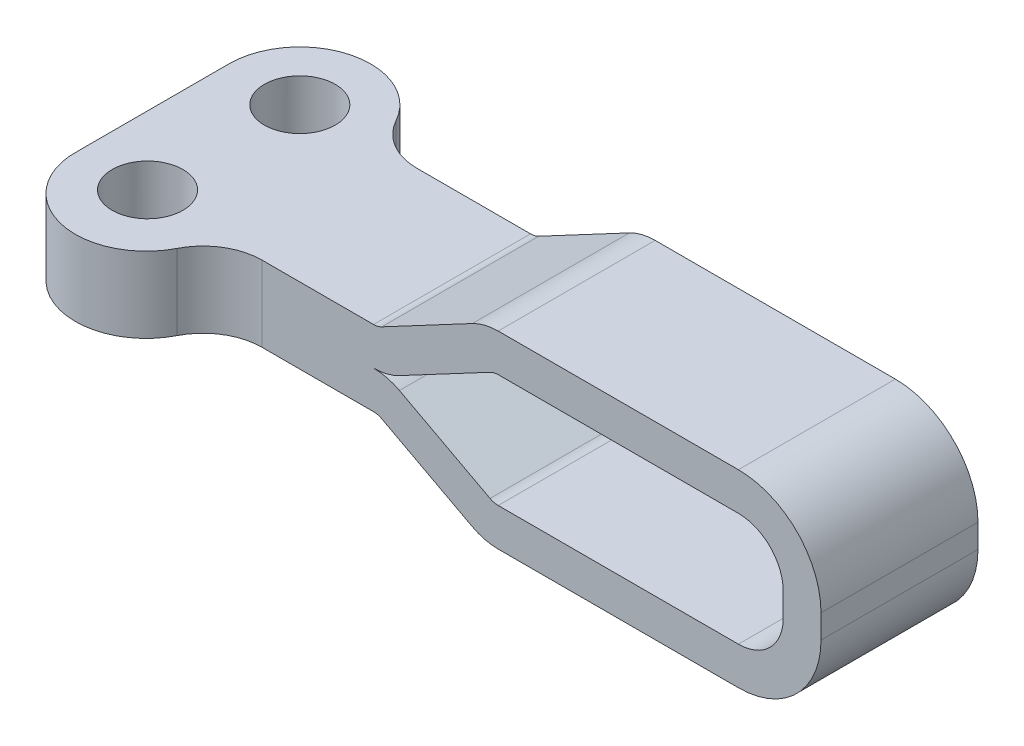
ISO-10303-21;
HEADER;
FILE_DESCRIPTION(('STEP AP214'),'2;1');
FILE_NAME('part.step','',(''),(''),'','','');
FILE_SCHEMA(('AUTOMOTIVE_DESIGN { 1 0 10303 214 1 1 1 1 }'));
ENDSEC;
DATA;
#1=APPLICATION_CONTEXT('core data for automotive mechanical design processes');
#2=APPLICATION_PROTOCOL_DEFINITION('international standard','automotive_design',2000,#1);
#3=PRODUCT_CONTEXT('',#1,'mechanical');
#4=PRODUCT('Part','Part','',(#3));
#5=PRODUCT_RELATED_PRODUCT_CATEGORY('part','',(#4));
#6=PRODUCT_DEFINITION_FORMATION('','',#4);
#7=PRODUCT_DEFINITION_CONTEXT('part definition',#1,'design');
#8=PRODUCT_DEFINITION('design','',#6,#7);
#9=PRODUCT_DEFINITION_SHAPE('','',#8);
#10=(LENGTH_UNIT() NAMED_UNIT(*) SI_UNIT(.MILLI.,.METRE.));
#11=(NAMED_UNIT(*) PLANE_ANGLE_UNIT() SI_UNIT($,.RADIAN.));
#12=(NAMED_UNIT(*) SI_UNIT($,.STERADIAN.) SOLID_ANGLE_UNIT());
#13=UNCERTAINTY_MEASURE_WITH_UNIT(LENGTH_MEASURE(1.E-05),#10,'distance_accuracy_value','');
#14=(GEOMETRIC_REPRESENTATION_CONTEXT(3) GLOBAL_UNCERTAINTY_ASSIGNED_CONTEXT((#13)) GLOBAL_UNIT_ASSIGNED_CONTEXT((#10,
#11,#12)) REPRESENTATION_CONTEXT('',''));
#15=CARTESIAN_POINT('',(0.,0.,0.));
#16=DIRECTION('',(0.,0.,1.));
#17=DIRECTION('',(1.,0.,0.));
#18=AXIS2_PLACEMENT_3D('',#15,#16,#17);
#19=CARTESIAN_POINT('',(29.93,1.6,0.149999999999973));
#20=DIRECTION('',(0.,0.,1.));
#21=DIRECTION('',(0.,-1.,0.));
#22=AXIS2_PLACEMENT_3D('',#19,#20,#21);
#23=PLANE('',#22);
#24=DIRECTION('',(0.,-1.,0.));
#25=VECTOR('',#24,1.);
#26=CARTESIAN_POINT('',(27.0794249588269,0.558341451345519,0.149999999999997));
#27=LINE('',#26,#25);
#28=CARTESIAN_POINT('',(27.0794249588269,0.5,0.149999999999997));
#29=VERTEX_POINT('',#28);
#30=CARTESIAN_POINT('',(27.0794249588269,-0.499999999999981,0.149999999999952));
#31=VERTEX_POINT('',#30);
#32=EDGE_CURVE('E243',#29,#31,#27,.T.);
#33=ORIENTED_EDGE('',*,*,#32,.T.);
#34=CARTESIAN_POINT('',(25.1794249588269,-0.5,0.149999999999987));
#35=DIRECTION('',(0.,0.,-1.));
#36=DIRECTION('',(0.,1.,0.));
#37=AXIS2_PLACEMENT_3D('',#34,#35,#36);
#38=CIRCLE('',#37,1.9);
#39=CARTESIAN_POINT('',(25.1794249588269,-2.4,0.149999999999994));
#40=VERTEX_POINT('',#39);
#41=EDGE_CURVE('E230',#31,#40,#38,.T.);
#42=ORIENTED_EDGE('',*,*,#41,.T.);
#43=DIRECTION('',(1.,0.,0.));
#44=VECTOR('',#43,1.);
#45=CARTESIAN_POINT('',(-0.467766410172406,-2.4,0.149999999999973));
#46=LINE('',#45,#44);
#47=CARTESIAN_POINT('',(15.0045161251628,-2.4,0.150000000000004));
#48=VERTEX_POINT('',#47);
#49=EDGE_CURVE('E223',#40,#48,#46,.F.);
#50=ORIENTED_EDGE('',*,*,#49,.T.);
#51=CARTESIAN_POINT('',(15.0045161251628,-1.6634,0.15));
#52=DIRECTION('',(0.,0.,-1.));
#53=DIRECTION('',(1.,0.,0.));
#54=AXIS2_PLACEMENT_3D('',#51,#52,#53);
#55=CIRCLE('',#54,0.7366);
#56=CARTESIAN_POINT('',(14.6587033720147,-2.31377919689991,0.149999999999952));
#57=VERTEX_POINT('',#56);
#58=EDGE_CURVE('E229',#57,#48,#55,.F.);
#59=ORIENTED_EDGE('',*,*,#58,.F.);
#60=DIRECTION('',(0.882947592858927,-0.469471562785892,0.));
#61=VECTOR('',#60,1.);
#62=CARTESIAN_POINT('',(1.66051566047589,4.59747980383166,0.149999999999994));
#63=LINE('',#62,#61);
#64=CARTESIAN_POINT('',(10.8215050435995,-0.273504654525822,0.149999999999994));
#65=VERTEX_POINT('',#64);
#66=EDGE_CURVE('E269',#57,#65,#63,.F.);
#67=ORIENTED_EDGE('',*,*,#66,.T.);
#68=CARTESIAN_POINT('',(9.72453778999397,-2.3366,0.149999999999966));
#69=DIRECTION('',(0.,0.,-1.));
#70=DIRECTION('',(1.,0.,0.));
#71=AXIS2_PLACEMENT_3D('',#68,#69,#70);
#72=CIRCLE('',#71,2.3366);
#73=CARTESIAN_POINT('',(9.72453778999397,0.,0.150000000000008));
#74=VERTEX_POINT('',#73);
#75=EDGE_CURVE('E245',#74,#65,#72,.T.);
#76=ORIENTED_EDGE('',*,*,#75,.F.);
#77=CARTESIAN_POINT('',(9.72453778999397,2.3366,0.15));
#78=DIRECTION('',(0.,0.,-1.));
#79=DIRECTION('',(1.,0.,0.));
#80=AXIS2_PLACEMENT_3D('',#77,#78,#79);
#81=CIRCLE('',#80,2.3366);
#82=CARTESIAN_POINT('',(10.8215050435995,0.273504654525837,0.149999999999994));
#83=VERTEX_POINT('',#82);
#84=EDGE_CURVE('E402',#83,#74,#81,.T.);
#85=ORIENTED_EDGE('',*,*,#84,.F.);
#86=DIRECTION('',(0.882947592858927,0.469471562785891,0.));
#87=VECTOR('',#86,1.);
#88=CARTESIAN_POINT('',(10.8215050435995,0.273504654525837,0.149999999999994));
#89=LINE('',#88,#87);
#90=CARTESIAN_POINT('',(14.6587033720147,2.3137791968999,0.14999999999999));
#91=VERTEX_POINT('',#90);
#92=EDGE_CURVE('E484',#83,#91,#89,.T.);
#93=ORIENTED_EDGE('',*,*,#92,.T.);
#94=CARTESIAN_POINT('',(15.0045161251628,1.6634,0.14999999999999));
#95=DIRECTION('',(0.,0.,-1.));
#96=DIRECTION('',(1.,0.,0.));
#97=AXIS2_PLACEMENT_3D('',#94,#95,#96);
#98=CIRCLE('',#97,0.7366);
#99=CARTESIAN_POINT('',(15.0045161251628,2.4,0.14999999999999));
#100=VERTEX_POINT('',#99);
#101=EDGE_CURVE('E418',#91,#100,#98,.T.);
#102=ORIENTED_EDGE('',*,*,#101,.T.);
#103=DIRECTION('',(1.,0.,0.));
#104=VECTOR('',#103,1.);
#105=CARTESIAN_POINT('',(29.3622335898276,2.4,0.149999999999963));
#106=LINE('',#105,#104);
#107=CARTESIAN_POINT('',(25.1794249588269,2.4,0.14999999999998));
#108=VERTEX_POINT('',#107);
#109=EDGE_CURVE('E362',#100,#108,#106,.T.);
#110=ORIENTED_EDGE('',*,*,#109,.T.);
#111=CARTESIAN_POINT('',(25.1794249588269,0.5,0.149999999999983));
#112=DIRECTION('',(0.,0.,-1.));
#113=DIRECTION('',(0.,1.,0.));
#114=AXIS2_PLACEMENT_3D('',#111,#112,#113);
#115=CIRCLE('',#114,1.9);
#116=EDGE_CURVE('E366',#108,#29,#115,.T.);
#117=ORIENTED_EDGE('',*,*,#116,.T.);
#118=EDGE_LOOP('',(#33,#42,#50,#59,#67,#76,#85,#93,#102,#110,#117));
#119=FACE_BOUND('',#118,.T.);
#120=CARTESIAN_POINT('',(25.1794249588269,-0.5,0.149999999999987));
#121=DIRECTION('',(0.,0.,-1.));
#122=DIRECTION('',(0.,1.,0.));
#123=AXIS2_PLACEMENT_3D('',#120,#121,#122);
#124=CIRCLE('',#123,3.5);
#125=CARTESIAN_POINT('',(28.6794249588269,-0.499999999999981,0.14999999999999));
#126=VERTEX_POINT('',#125);
#127=CARTESIAN_POINT('',(25.1794249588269,-4.,0.149999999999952));
#128=VERTEX_POINT('',#127);
#129=EDGE_CURVE('E196',#126,#128,#124,.T.);
#130=ORIENTED_EDGE('',*,*,#129,.F.);
#131=DIRECTION('',(0.,-1.,0.));
#132=VECTOR('',#131,1.);
#133=CARTESIAN_POINT('',(28.6794249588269,0.558341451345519,0.149999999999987));
#134=LINE('',#133,#132);
#135=CARTESIAN_POINT('',(28.6794249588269,0.5,0.149999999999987));
#136=VERTEX_POINT('',#135);
#137=EDGE_CURVE('E338',#126,#136,#134,.F.);
#138=ORIENTED_EDGE('',*,*,#137,.T.);
#139=CARTESIAN_POINT('',(25.1794249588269,0.5,0.149999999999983));
#140=DIRECTION('',(0.,0.,-1.));
#141=DIRECTION('',(0.,1.,0.));
#142=AXIS2_PLACEMENT_3D('',#139,#140,#141);
#143=CIRCLE('',#142,3.5);
#144=CARTESIAN_POINT('',(25.1794249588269,4.,0.149999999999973));
#145=VERTEX_POINT('',#144);
#146=EDGE_CURVE('E341',#145,#136,#143,.T.);
#147=ORIENTED_EDGE('',*,*,#146,.F.);
#148=DIRECTION('',(1.,0.,0.));
#149=VECTOR('',#148,1.);
#150=CARTESIAN_POINT('',(-0.467766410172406,4.,0.15));
#151=LINE('',#150,#149);
#152=CARTESIAN_POINT('',(15.0045161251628,4.,0.149999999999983));
#153=VERTEX_POINT('',#152);
#154=EDGE_CURVE('E420',#145,#153,#151,.F.);
#155=ORIENTED_EDGE('',*,*,#154,.T.);
#156=CARTESIAN_POINT('',(15.0045161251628,1.6634,0.14999999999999));
#157=DIRECTION('',(0.,0.,-1.));
#158=DIRECTION('',(1.,0.,0.));
#159=AXIS2_PLACEMENT_3D('',#156,#157,#158);
#160=CIRCLE('',#159,2.3366);
#161=CARTESIAN_POINT('',(13.9075488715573,3.72649534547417,0.149999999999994));
#162=VERTEX_POINT('',#161);
#163=EDGE_CURVE('E412',#162,#153,#160,.T.);
#164=ORIENTED_EDGE('',*,*,#163,.F.);
#165=DIRECTION('',(0.882947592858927,0.469471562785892,0.));
#166=VECTOR('',#165,1.);
#167=CARTESIAN_POINT('',(0.909361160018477,-3.18476365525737,0.149999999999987));
#168=LINE('',#167,#166);
#169=CARTESIAN_POINT('',(10.0703505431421,1.68622080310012,0.15));
#170=VERTEX_POINT('',#169);
#171=EDGE_CURVE('E400',#162,#170,#168,.F.);
#172=ORIENTED_EDGE('',*,*,#171,.T.);
#173=CARTESIAN_POINT('',(9.72453778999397,2.3366,0.15));
#174=DIRECTION('',(0.,0.,-1.));
#175=DIRECTION('',(1.,0.,0.));
#176=AXIS2_PLACEMENT_3D('',#173,#174,#175);
#177=CIRCLE('',#176,0.7366);
#178=CARTESIAN_POINT('',(9.72453778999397,1.6,0.15));
#179=VERTEX_POINT('',#178);
#180=EDGE_CURVE('E405',#179,#170,#177,.F.);
#181=ORIENTED_EDGE('',*,*,#180,.F.);
#182=DIRECTION('',(1.,0.,0.));
#183=VECTOR('',#182,1.);
#184=CARTESIAN_POINT('',(0.100000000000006,1.6,0.149999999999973));
#185=LINE('',#184,#183);
#186=CARTESIAN_POINT('',(5.00146296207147,1.6,0.149999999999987));
#187=VERTEX_POINT('',#186);
#188=EDGE_CURVE('E396',#179,#187,#185,.F.);
#189=ORIENTED_EDGE('',*,*,#188,.T.);
#190=DIRECTION('',(0.,-1.,0.));
#191=VECTOR('',#190,1.);
#192=CARTESIAN_POINT('',(5.00146296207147,1.6,0.149999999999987));
#193=LINE('',#192,#191);
#194=CARTESIAN_POINT('',(5.00146296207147,-1.6,0.149999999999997));
#195=VERTEX_POINT('',#194);
#196=EDGE_CURVE('E479',#187,#195,#193,.T.);
#197=ORIENTED_EDGE('',*,*,#196,.T.);
#198=DIRECTION('',(1.,0.,0.));
#199=VECTOR('',#198,1.);
#200=CARTESIAN_POINT('',(29.93,-1.6,0.149999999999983));
#201=LINE('',#200,#199);
#202=CARTESIAN_POINT('',(9.72453778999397,-1.6,0.149999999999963));
#203=VERTEX_POINT('',#202);
#204=EDGE_CURVE('E261',#195,#203,#201,.T.);
#205=ORIENTED_EDGE('',*,*,#204,.T.);
#206=CARTESIAN_POINT('',(9.72453778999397,-2.3366,0.149999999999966));
#207=DIRECTION('',(0.,0.,-1.));
#208=DIRECTION('',(1.,0.,0.));
#209=AXIS2_PLACEMENT_3D('',#206,#207,#208);
#210=CIRCLE('',#209,0.7366);
#211=CARTESIAN_POINT('',(10.0703505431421,-1.6862208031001,0.149999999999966));
#212=VERTEX_POINT('',#211);
#213=EDGE_CURVE('E266',#203,#212,#210,.T.);
#214=ORIENTED_EDGE('',*,*,#213,.T.);
#215=DIRECTION('',(0.882947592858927,-0.469471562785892,0.));
#216=VECTOR('',#215,1.);
#217=CARTESIAN_POINT('',(10.0703505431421,-1.6862208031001,0.149999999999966));
#218=LINE('',#217,#216);
#219=CARTESIAN_POINT('',(13.9075488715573,-3.72649534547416,0.14999999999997));
#220=VERTEX_POINT('',#219);
#221=EDGE_CURVE('E321',#212,#220,#218,.T.);
#222=ORIENTED_EDGE('',*,*,#221,.T.);
#223=CARTESIAN_POINT('',(15.0045161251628,-1.6634,0.15));
#224=DIRECTION('',(0.,0.,-1.));
#225=DIRECTION('',(1.,0.,0.));
#226=AXIS2_PLACEMENT_3D('',#223,#224,#225);
#227=CIRCLE('',#226,2.3366);
#228=CARTESIAN_POINT('',(15.0045161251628,-4.,0.149999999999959));
#229=VERTEX_POINT('',#228);
#230=EDGE_CURVE('E273',#229,#220,#227,.T.);
#231=ORIENTED_EDGE('',*,*,#230,.F.);
#232=DIRECTION('',(1.,0.,0.));
#233=VECTOR('',#232,1.);
#234=CARTESIAN_POINT('',(29.3622335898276,-4.,0.149999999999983));
#235=LINE('',#234,#233);
#236=EDGE_CURVE('E204',#229,#128,#235,.T.);
#237=ORIENTED_EDGE('',*,*,#236,.T.);
#238=EDGE_LOOP('',(#130,#138,#147,#155,#164,#172,#181,#189,#197,#205,#214,#222,#231,#237));
#239=FACE_BOUND('',#238,.T.);
#240=ADVANCED_FACE('F14',(#119,#239),#23,.T.);
#241=CARTESIAN_POINT('',(5.0014629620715,1.6,2.65));
#242=DIRECTION('',(0.,-1.,0.));
#243=DIRECTION('',(1.,0.,0.));
#244=AXIS2_PLACEMENT_3D('',#241,#242,#243);
#245=CYLINDRICAL_SURFACE('',#244,2.5);
#246=ORIENTED_EDGE('',*,*,#196,.F.);
#247=CARTESIAN_POINT('',(5.0014629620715,1.6,2.65));
#248=DIRECTION('',(0.,-1.,0.));
#249=DIRECTION('',(1.,0.,0.));
#250=AXIS2_PLACEMENT_3D('',#247,#248,#249);
#251=CIRCLE('',#250,2.5);
#252=CARTESIAN_POINT('',(2.7725894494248,1.6,1.51769135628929));
#253=VERTEX_POINT('',#252);
#254=EDGE_CURVE('E393',#187,#253,#251,.F.);
#255=ORIENTED_EDGE('',*,*,#254,.T.);
#256=DIRECTION('',(0.,-1.,0.));
#257=VECTOR('',#256,1.);
#258=CARTESIAN_POINT('',(2.7725894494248,1.6,1.51769135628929));
#259=LINE('',#258,#257);
#260=CARTESIAN_POINT('',(2.7725894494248,-1.6,1.5176913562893));
#261=VERTEX_POINT('',#260);
#262=EDGE_CURVE('E477',#261,#253,#259,.F.);
#263=ORIENTED_EDGE('',*,*,#262,.F.);
#264=CARTESIAN_POINT('',(5.0014629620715,-1.6,2.64999999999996));
#265=DIRECTION('',(0.,-1.,0.));
#266=DIRECTION('',(1.,0.,0.));
#267=AXIS2_PLACEMENT_3D('',#264,#265,#266);
#268=CIRCLE('',#267,2.5);
#269=EDGE_CURVE('E258',#195,#261,#268,.F.);
#270=ORIENTED_EDGE('',*,*,#269,.F.);
#271=EDGE_LOOP('',(#246,#255,#263,#270));
#272=FACE_BOUND('',#271,.T.);
#273=ADVANCED_FACE('F611',(#272),#245,.F.);
#274=CARTESIAN_POINT('',(0.0977405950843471,1.6,0.158819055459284));
#275=DIRECTION('',(0.,-1.,0.));
#276=DIRECTION('',(1.,0.,0.));
#277=AXIS2_PLACEMENT_3D('',#274,#275,#276);
#278=CYLINDRICAL_SURFACE('',#277,3.00022504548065);
#279=CARTESIAN_POINT('',(0.0977405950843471,1.6,0.158819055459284));
#280=DIRECTION('',(0.,-1.,0.));
#281=DIRECTION('',(1.,0.,0.));
#282=AXIS2_PLACEMENT_3D('',#279,#280,#281);
#283=CIRCLE('',#282,3.00022504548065);
#284=CARTESIAN_POINT('',(-2.9,1.6,0.0367467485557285));
#285=VERTEX_POINT('',#284);
#286=EDGE_CURVE('E390',#253,#285,#283,.T.);
#287=ORIENTED_EDGE('',*,*,#286,.T.);
#288=DIRECTION('',(0.,-1.,0.));
#289=VECTOR('',#288,1.);
#290=CARTESIAN_POINT('',(-2.9,1.6,0.0367467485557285));
#291=LINE('',#290,#289);
#292=CARTESIAN_POINT('',(-2.9,-1.6,0.0367467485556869));
#293=VERTEX_POINT('',#292);
#294=EDGE_CURVE('E457',#293,#285,#291,.F.);
#295=ORIENTED_EDGE('',*,*,#294,.F.);
#296=CARTESIAN_POINT('',(0.0977405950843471,-1.6,0.158819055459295));
#297=DIRECTION('',(0.,-1.,0.));
#298=DIRECTION('',(1.,0.,0.));
#299=AXIS2_PLACEMENT_3D('',#296,#297,#298);
#300=CIRCLE('',#299,3.00022504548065);
#301=EDGE_CURVE('E255',#293,#261,#300,.F.);
#302=ORIENTED_EDGE('',*,*,#301,.T.);
#303=ORIENTED_EDGE('',*,*,#262,.T.);
#304=EDGE_LOOP('',(#287,#295,#302,#303));
#305=FACE_BOUND('',#304,.T.);
#306=ADVANCED_FACE('F609',(#305),#278,.T.);
#307=CARTESIAN_POINT('',(-2.9,1.6,0.0367467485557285));
#308=DIRECTION('',(-1.,0.,0.));
#309=DIRECTION('',(0.,-1.,0.));
#310=AXIS2_PLACEMENT_3D('',#307,#308,#309);
#311=PLANE('',#310);
#312=DIRECTION('',(0.,0.,1.));
#313=VECTOR('',#312,1.);
#314=CARTESIAN_POINT('',(-2.9,1.6,-6.35));
#315=LINE('',#314,#313);
#316=CARTESIAN_POINT('',(-2.9,1.6,-6.38674674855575));
#317=VERTEX_POINT('',#316);
#318=EDGE_CURVE('E389',#285,#317,#315,.F.);
#319=ORIENTED_EDGE('',*,*,#318,.T.);
#320=DIRECTION('',(0.,-1.,0.));
#321=VECTOR('',#320,1.);
#322=CARTESIAN_POINT('',(-2.9,1.6,-6.3867467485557));
#323=LINE('',#322,#321);
#324=CARTESIAN_POINT('',(-2.9,-1.6,-6.38674674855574));
#325=VERTEX_POINT('',#324);
#326=EDGE_CURVE('E449',#325,#317,#323,.F.);
#327=ORIENTED_EDGE('',*,*,#326,.F.);
#328=DIRECTION('',(0.,0.,1.));
#329=VECTOR('',#328,1.);
#330=CARTESIAN_POINT('',(-2.9,-1.6,0.0367467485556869));
#331=LINE('',#330,#329);
#332=EDGE_CURVE('E254',#325,#293,#331,.T.);
#333=ORIENTED_EDGE('',*,*,#332,.T.);
#334=ORIENTED_EDGE('',*,*,#294,.T.);
#335=EDGE_LOOP('',(#319,#327,#333,#334));
#336=FACE_BOUND('',#335,.T.);
#337=ADVANCED_FACE('F465',(#336),#311,.T.);
#338=CARTESIAN_POINT('',(0.0999999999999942,1.6,-6.35));
#339=DIRECTION('',(0.,-1.,0.));
#340=DIRECTION('',(1.,0.,0.));
#341=AXIS2_PLACEMENT_3D('',#338,#339,#340);
#342=CYLINDRICAL_SURFACE('',#341,3.00022504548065);
#343=CARTESIAN_POINT('',(0.0999999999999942,1.6,-6.35));
#344=DIRECTION('',(0.,-1.,0.));
#345=DIRECTION('',(1.,0.,0.));
#346=AXIS2_PLACEMENT_3D('',#343,#344,#345);
#347=CIRCLE('',#346,3.00022504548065);
#348=CARTESIAN_POINT('',(2.72904336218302,1.6,-7.7955038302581));
#349=VERTEX_POINT('',#348);
#350=EDGE_CURVE('E386',#317,#349,#347,.T.);
#351=ORIENTED_EDGE('',*,*,#350,.T.);
#352=DIRECTION('',(0.,-1.,0.));
#353=VECTOR('',#352,1.);
#354=CARTESIAN_POINT('',(2.72904336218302,1.6,-7.7955038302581));
#355=LINE('',#354,#353);
#356=CARTESIAN_POINT('',(2.72904336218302,-1.6,-7.79550383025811));
#357=VERTEX_POINT('',#356);
#358=EDGE_CURVE('E456',#349,#357,#355,.T.);
#359=ORIENTED_EDGE('',*,*,#358,.T.);
#360=CARTESIAN_POINT('',(0.0999999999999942,-1.6,-6.35));
#361=DIRECTION('',(0.,-1.,0.));
#362=DIRECTION('',(1.,0.,0.));
#363=AXIS2_PLACEMENT_3D('',#360,#361,#362);
#364=CIRCLE('',#363,3.00022504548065);
#365=EDGE_CURVE('E251',#357,#325,#364,.F.);
#366=ORIENTED_EDGE('',*,*,#365,.T.);
#367=ORIENTED_EDGE('',*,*,#326,.T.);
#368=EDGE_LOOP('',(#351,#359,#366,#367));
#369=FACE_BOUND('',#368,.T.);
#370=ADVANCED_FACE('F451',(#369),#342,.T.);
#371=CARTESIAN_POINT('',(28.679424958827,30.3883414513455,-6.35));
#372=DIRECTION('',(-1.,0.,0.));
#373=DIRECTION('',(0.,-1.,0.));
#374=AXIS2_PLACEMENT_3D('',#371,#372,#373);
#375=PLANE('',#374);
#376=DIRECTION('',(0.,0.,-1.));
#377=VECTOR('',#376,1.);
#378=CARTESIAN_POINT('',(28.6794249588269,0.499999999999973,4.87297204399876));
#379=LINE('',#378,#377);
#380=CARTESIAN_POINT('',(28.6794249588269,0.499999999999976,-6.5));
#381=VERTEX_POINT('',#380);
#382=EDGE_CURVE('E350',#136,#381,#379,.T.);
#383=ORIENTED_EDGE('',*,*,#382,.F.);
#384=ORIENTED_EDGE('',*,*,#137,.F.);
#385=DIRECTION('',(0.,0.,-1.));
#386=VECTOR('',#385,1.);
#387=CARTESIAN_POINT('',(28.6794249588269,-0.499999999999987,4.87297204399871));
#388=LINE('',#387,#386);
#389=CARTESIAN_POINT('',(28.6794249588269,-0.499999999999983,-6.5));
#390=VERTEX_POINT('',#389);
#391=EDGE_CURVE('E197',#390,#126,#388,.F.);
#392=ORIENTED_EDGE('',*,*,#391,.F.);
#393=DIRECTION('',(0.,-1.,0.));
#394=VECTOR('',#393,1.);
#395=CARTESIAN_POINT('',(28.679424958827,30.3883414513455,-6.5));
#396=LINE('',#395,#394);
#397=EDGE_CURVE('E192',#381,#390,#396,.T.);
#398=ORIENTED_EDGE('',*,*,#397,.F.);
#399=EDGE_LOOP('',(#383,#384,#392,#398));
#400=FACE_BOUND('',#399,.T.);
#401=ADVANCED_FACE('F355',(#400),#375,.F.);
#402=CARTESIAN_POINT('',(25.1794249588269,0.500000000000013,4.87297204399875));
#403=DIRECTION('',(0.,0.,-1.));
#404=DIRECTION('',(0.,1.,0.));
#405=AXIS2_PLACEMENT_3D('',#402,#403,#404);
#406=CYLINDRICAL_SURFACE('',#405,3.5);
#407=CARTESIAN_POINT('',(25.1794249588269,0.500000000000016,-6.5));
#408=DIRECTION('',(0.,0.,-1.));
#409=DIRECTION('',(0.,1.,0.));
#410=AXIS2_PLACEMENT_3D('',#407,#408,#409);
#411=CIRCLE('',#410,3.5);
#412=CARTESIAN_POINT('',(25.1794249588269,4.,-6.5));
#413=VERTEX_POINT('',#412);
#414=EDGE_CURVE('E356',#381,#413,#411,.F.);
#415=ORIENTED_EDGE('',*,*,#414,.T.);
#416=DIRECTION('',(0.,0.,-1.));
#417=VECTOR('',#416,1.);
#418=CARTESIAN_POINT('',(25.1794249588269,4.,-6.35));
#419=LINE('',#418,#417);
#420=EDGE_CURVE('E352',#413,#145,#419,.F.);
#421=ORIENTED_EDGE('',*,*,#420,.T.);
#422=ORIENTED_EDGE('',*,*,#146,.T.);
#423=ORIENTED_EDGE('',*,*,#382,.T.);
#424=EDGE_LOOP('',(#415,#421,#422,#423));
#425=FACE_BOUND('',#424,.T.);
#426=ADVANCED_FACE('F349',(#425),#406,.T.);
#427=CARTESIAN_POINT('',(-0.467766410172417,4.,-6.35));
#428=DIRECTION('',(0.,-1.,0.));
#429=DIRECTION('',(0.,0.,-1.));
#430=AXIS2_PLACEMENT_3D('',#427,#428,#429);
#431=PLANE('',#430);
#432=DIRECTION('',(1.,0.,0.));
#433=VECTOR('',#432,1.);
#434=CARTESIAN_POINT('',(-0.467766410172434,4.,-6.5));
#435=LINE('',#434,#433);
#436=CARTESIAN_POINT('',(15.0045161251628,4.,-6.5));
#437=VERTEX_POINT('',#436);
#438=EDGE_CURVE('E498',#437,#413,#435,.T.);
#439=ORIENTED_EDGE('',*,*,#438,.F.);
#440=DIRECTION('',(0.,0.,-1.));
#441=VECTOR('',#440,1.);
#442=CARTESIAN_POINT('',(15.0045161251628,4.,3.70587112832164));
#443=LINE('',#442,#441);
#444=EDGE_CURVE('E411',#153,#437,#443,.T.);
#445=ORIENTED_EDGE('',*,*,#444,.F.);
#446=ORIENTED_EDGE('',*,*,#154,.F.);
#447=ORIENTED_EDGE('',*,*,#420,.F.);
#448=EDGE_LOOP('',(#439,#445,#446,#447));
#449=FACE_BOUND('',#448,.T.);
#450=ADVANCED_FACE('F582',(#449),#431,.F.);
#451=CARTESIAN_POINT('',(15.0045161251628,1.6634,3.70587112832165));
#452=DIRECTION('',(0.,0.,-1.));
#453=DIRECTION('',(1.,0.,0.));
#454=AXIS2_PLACEMENT_3D('',#451,#452,#453);
#455=CYLINDRICAL_SURFACE('',#454,2.3366);
#456=CARTESIAN_POINT('',(15.0045161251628,1.6634,-6.5));
#457=DIRECTION('',(0.,0.,-1.));
#458=DIRECTION('',(1.,0.,0.));
#459=AXIS2_PLACEMENT_3D('',#456,#457,#458);
#460=CIRCLE('',#459,2.3366);
#461=CARTESIAN_POINT('',(13.9075488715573,3.72649534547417,-6.5));
#462=VERTEX_POINT('',#461);
#463=EDGE_CURVE('E409',#437,#462,#460,.F.);
#464=ORIENTED_EDGE('',*,*,#463,.T.);
#465=DIRECTION('',(0.,0.,1.));
#466=VECTOR('',#465,1.);
#467=CARTESIAN_POINT('',(13.9075488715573,3.72649534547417,-6.35));
#468=LINE('',#467,#466);
#469=EDGE_CURVE('E482',#462,#162,#468,.T.);
#470=ORIENTED_EDGE('',*,*,#469,.T.);
#471=ORIENTED_EDGE('',*,*,#163,.T.);
#472=ORIENTED_EDGE('',*,*,#444,.T.);
#473=EDGE_LOOP('',(#464,#470,#471,#472));
#474=FACE_BOUND('',#473,.T.);
#475=ADVANCED_FACE('F584',(#474),#455,.T.);
#476=CARTESIAN_POINT('',(0.909361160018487,-3.18476365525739,-6.35));
#477=DIRECTION('',(0.469471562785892,-0.882947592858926,0.));
#478=DIRECTION('',(0.882947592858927,0.469471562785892,0.));
#479=AXIS2_PLACEMENT_3D('',#476,#477,#478);
#480=PLANE('',#479);
#481=DIRECTION('',(0.882947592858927,0.469471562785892,0.));
#482=VECTOR('',#481,1.);
#483=CARTESIAN_POINT('',(0.90936116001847,-3.18476365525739,-6.5));
#484=LINE('',#483,#482);
#485=CARTESIAN_POINT('',(10.0703505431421,1.68622080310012,-6.5));
#486=VERTEX_POINT('',#485);
#487=EDGE_CURVE('E485',#486,#462,#484,.T.);
#488=ORIENTED_EDGE('',*,*,#487,.F.);
#489=DIRECTION('',(0.,0.,-1.));
#490=VECTOR('',#489,1.);
#491=CARTESIAN_POINT('',(10.070350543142,1.68622080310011,3.70587112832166));
#492=LINE('',#491,#490);
#493=EDGE_CURVE('E472',#486,#170,#492,.F.);
#494=ORIENTED_EDGE('',*,*,#493,.T.);
#495=ORIENTED_EDGE('',*,*,#171,.F.);
#496=ORIENTED_EDGE('',*,*,#469,.F.);
#497=EDGE_LOOP('',(#488,#494,#495,#496));
#498=FACE_BOUND('',#497,.T.);
#499=ADVANCED_FACE('F590',(#498),#480,.F.);
#500=CARTESIAN_POINT('',(9.72453778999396,2.3366,3.70587112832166));
#501=DIRECTION('',(0.,0.,-1.));
#502=DIRECTION('',(1.,0.,0.));
#503=AXIS2_PLACEMENT_3D('',#500,#501,#502);
#504=CYLINDRICAL_SURFACE('',#503,0.7366);
#505=ORIENTED_EDGE('',*,*,#493,.F.);
#506=CARTESIAN_POINT('',(9.72453778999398,2.3366,-6.5));
#507=DIRECTION('',(0.,0.,-1.));
#508=DIRECTION('',(1.,0.,0.));
#509=AXIS2_PLACEMENT_3D('',#506,#507,#508);
#510=CIRCLE('',#509,0.7366);
#511=CARTESIAN_POINT('',(9.72453778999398,1.6,-6.5));
#512=VERTEX_POINT('',#511);
#513=EDGE_CURVE('E32',#486,#512,#510,.T.);
#514=ORIENTED_EDGE('',*,*,#513,.T.);
#515=DIRECTION('',(0.,0.,1.));
#516=VECTOR('',#515,1.);
#517=CARTESIAN_POINT('',(9.72453778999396,1.6,-6.35));
#518=LINE('',#517,#516);
#519=EDGE_CURVE('E9',#512,#179,#518,.T.);
#520=ORIENTED_EDGE('',*,*,#519,.T.);
#521=ORIENTED_EDGE('',*,*,#180,.T.);
#522=EDGE_LOOP('',(#505,#514,#520,#521));
#523=FACE_BOUND('',#522,.T.);
#524=ADVANCED_FACE('F600',(#523),#504,.F.);
#525=CARTESIAN_POINT('',(0.0999999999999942,1.6,-6.35));
#526=DIRECTION('',(0.,-1.,0.));
#527=DIRECTION('',(1.,0.,0.));
#528=AXIS2_PLACEMENT_3D('',#525,#526,#527);
#529=PLANE('',#528);
#530=CARTESIAN_POINT('',(0.,1.6,0.));
#531=DIRECTION('',(0.,1.,0.));
#532=DIRECTION('',(0.,0.,1.));
#533=AXIS2_PLACEMENT_3D('',#530,#531,#532);
#534=CIRCLE('',#533,1.5);
#535=CARTESIAN_POINT('',(0.,1.6,1.5));
#536=VERTEX_POINT('',#535);
#537=EDGE_CURVE('E815',#536,#536,#534,.T.);
#538=ORIENTED_EDGE('',*,*,#537,.F.);
#539=EDGE_LOOP('',(#538));
#540=FACE_BOUND('',#539,.T.);
#541=CARTESIAN_POINT('',(0.0999999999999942,1.6,-6.35));
#542=DIRECTION('',(0.,1.,0.));
#543=DIRECTION('',(0.,0.,1.));
#544=AXIS2_PLACEMENT_3D('',#541,#542,#543);
#545=CIRCLE('',#544,1.5);
#546=CARTESIAN_POINT('',(0.0999999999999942,1.6,-4.85));
#547=VERTEX_POINT('',#546);
#548=EDGE_CURVE('E822',#547,#547,#545,.T.);
#549=ORIENTED_EDGE('',*,*,#548,.F.);
#550=EDGE_LOOP('',(#549));
#551=FACE_BOUND('',#550,.T.);
#552=DIRECTION('',(1.,0.,0.));
#553=VECTOR('',#552,1.);
#554=CARTESIAN_POINT('',(0.0999999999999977,1.6,-6.5));
#555=LINE('',#554,#553);
#556=CARTESIAN_POINT('',(4.9197484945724,1.6,-6.5));
#557=VERTEX_POINT('',#556);
#558=EDGE_CURVE('E24',#557,#512,#555,.T.);
#559=ORIENTED_EDGE('',*,*,#558,.F.);
#560=CARTESIAN_POINT('',(4.91974849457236,1.6,-9.));
#561=DIRECTION('',(0.,-1.,0.));
#562=DIRECTION('',(1.,0.,0.));
#563=AXIS2_PLACEMENT_3D('',#560,#561,#562);
#564=CIRCLE('',#563,2.5);
#565=EDGE_CURVE('E383',#349,#557,#564,.F.);
#566=ORIENTED_EDGE('',*,*,#565,.F.);
#567=ORIENTED_EDGE('',*,*,#350,.F.);
#568=ORIENTED_EDGE('',*,*,#318,.F.);
#569=ORIENTED_EDGE('',*,*,#286,.F.);
#570=ORIENTED_EDGE('',*,*,#254,.F.);
#571=ORIENTED_EDGE('',*,*,#188,.F.);
#572=ORIENTED_EDGE('',*,*,#519,.F.);
#573=EDGE_LOOP('',(#559,#566,#567,#568,#569,#570,#571,#572));
#574=FACE_BOUND('',#573,.T.);
#575=ADVANCED_FACE('F463',(#540,#551,#574),#529,.F.);
#576=CARTESIAN_POINT('',(4.91974849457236,1.6,-9.));
#577=DIRECTION('',(0.,-1.,0.));
#578=DIRECTION('',(1.,0.,0.));
#579=AXIS2_PLACEMENT_3D('',#576,#577,#578);
#580=CYLINDRICAL_SURFACE('',#579,2.5);
#581=ORIENTED_EDGE('',*,*,#358,.F.);
#582=ORIENTED_EDGE('',*,*,#565,.T.);
#583=DIRECTION('',(0.,1.,0.));
#584=VECTOR('',#583,1.);
#585=CARTESIAN_POINT('',(4.9197484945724,1.6,-6.5));
#586=LINE('',#585,#584);
#587=CARTESIAN_POINT('',(4.9197484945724,-1.6,-6.5));
#588=VERTEX_POINT('',#587);
#589=EDGE_CURVE('E473',#588,#557,#586,.T.);
#590=ORIENTED_EDGE('',*,*,#589,.F.);
#591=CARTESIAN_POINT('',(4.91974849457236,-1.6,-9.));
#592=DIRECTION('',(0.,-1.,0.));
#593=DIRECTION('',(1.,0.,0.));
#594=AXIS2_PLACEMENT_3D('',#591,#592,#593);
#595=CIRCLE('',#594,2.5);
#596=EDGE_CURVE('E248',#357,#588,#595,.F.);
#597=ORIENTED_EDGE('',*,*,#596,.F.);
#598=EDGE_LOOP('',(#581,#582,#590,#597));
#599=FACE_BOUND('',#598,.T.);
#600=ADVANCED_FACE('F527',(#599),#580,.F.);
#601=CARTESIAN_POINT('',(9.72453778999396,2.3366,3.70587112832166));
#602=DIRECTION('',(0.,0.,-1.));
#603=DIRECTION('',(1.,0.,0.));
#604=AXIS2_PLACEMENT_3D('',#601,#602,#603);
#605=CYLINDRICAL_SURFACE('',#604,2.3366);
#606=CARTESIAN_POINT('',(9.72453778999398,2.3366,-6.5));
#607=DIRECTION('',(0.,0.,-1.));
#608=DIRECTION('',(1.,0.,0.));
#609=AXIS2_PLACEMENT_3D('',#606,#607,#608);
#610=CIRCLE('',#609,2.3366);
#611=CARTESIAN_POINT('',(9.72453778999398,0.,-6.5));
#612=VERTEX_POINT('',#611);
#613=CARTESIAN_POINT('',(10.8215050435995,0.273504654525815,-6.5));
#614=VERTEX_POINT('',#613);
#615=EDGE_CURVE('E397',#612,#614,#610,.F.);
#616=ORIENTED_EDGE('',*,*,#615,.T.);
#617=DIRECTION('',(0.,0.,-1.));
#618=VECTOR('',#617,1.);
#619=CARTESIAN_POINT('',(10.8215050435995,0.273504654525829,3.70587112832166));
#620=LINE('',#619,#618);
#621=EDGE_CURVE('E408',#614,#83,#620,.F.);
#622=ORIENTED_EDGE('',*,*,#621,.T.);
#623=ORIENTED_EDGE('',*,*,#84,.T.);
#624=DIRECTION('',(0.,0.,1.));
#625=VECTOR('',#624,1.);
#626=CARTESIAN_POINT('',(9.72453778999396,0.,-6.35));
#627=LINE('',#626,#625);
#628=EDGE_CURVE('E434',#612,#74,#627,.T.);
#629=ORIENTED_EDGE('',*,*,#628,.F.);
#630=EDGE_LOOP('',(#616,#622,#623,#629));
#631=FACE_BOUND('',#630,.T.);
#632=ADVANCED_FACE('F432',(#631),#605,.T.);
#633=CARTESIAN_POINT('',(1.6605156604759,-4.59747980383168,-6.35));
#634=DIRECTION('',(0.469471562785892,-0.882947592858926,0.));
#635=DIRECTION('',(0.882947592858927,0.469471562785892,0.));
#636=AXIS2_PLACEMENT_3D('',#633,#634,#635);
#637=PLANE('',#636);
#638=ORIENTED_EDGE('',*,*,#92,.F.);
#639=ORIENTED_EDGE('',*,*,#621,.F.);
#640=DIRECTION('',(-0.882947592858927,-0.469471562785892,0.));
#641=VECTOR('',#640,1.);
#642=CARTESIAN_POINT('',(14.6587033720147,2.31377919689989,-6.5));
#643=LINE('',#642,#641);
#644=CARTESIAN_POINT('',(14.6587033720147,2.31377919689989,-6.5));
#645=VERTEX_POINT('',#644);
#646=EDGE_CURVE('E414',#645,#614,#643,.T.);
#647=ORIENTED_EDGE('',*,*,#646,.F.);
#648=DIRECTION('',(0.,0.,1.));
#649=VECTOR('',#648,1.);
#650=CARTESIAN_POINT('',(14.6587033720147,2.31377919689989,-6.35));
#651=LINE('',#650,#649);
#652=EDGE_CURVE('E417',#645,#91,#651,.T.);
#653=ORIENTED_EDGE('',*,*,#652,.T.);
#654=EDGE_LOOP('',(#638,#639,#647,#653));
#655=FACE_BOUND('',#654,.T.);
#656=ADVANCED_FACE('F517',(#655),#637,.T.);
#657=CARTESIAN_POINT('',(15.0045161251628,1.6634,3.70587112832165));
#658=DIRECTION('',(0.,0.,-1.));
#659=DIRECTION('',(1.,0.,0.));
#660=AXIS2_PLACEMENT_3D('',#657,#658,#659);
#661=CYLINDRICAL_SURFACE('',#660,0.7366);
#662=ORIENTED_EDGE('',*,*,#652,.F.);
#663=CARTESIAN_POINT('',(15.0045161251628,1.6634,-6.5));
#664=DIRECTION('',(0.,0.,-1.));
#665=DIRECTION('',(1.,0.,0.));
#666=AXIS2_PLACEMENT_3D('',#663,#664,#665);
#667=CIRCLE('',#666,0.7366);
#668=CARTESIAN_POINT('',(15.0045161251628,2.4,-6.5));
#669=VERTEX_POINT('',#668);
#670=EDGE_CURVE('E415',#669,#645,#667,.F.);
#671=ORIENTED_EDGE('',*,*,#670,.F.);
#672=DIRECTION('',(0.,0.,-1.));
#673=VECTOR('',#672,1.);
#674=CARTESIAN_POINT('',(15.0045161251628,2.4,3.70587112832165));
#675=LINE('',#674,#673);
#676=EDGE_CURVE('E358',#100,#669,#675,.T.);
#677=ORIENTED_EDGE('',*,*,#676,.F.);
#678=ORIENTED_EDGE('',*,*,#101,.F.);
#679=EDGE_LOOP('',(#662,#671,#677,#678));
#680=FACE_BOUND('',#679,.T.);
#681=ADVANCED_FACE('F513',(#680),#661,.F.);
#682=CARTESIAN_POINT('',(-0.467766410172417,2.4,-6.35));
#683=DIRECTION('',(0.,-1.,0.));
#684=DIRECTION('',(0.,0.,-1.));
#685=AXIS2_PLACEMENT_3D('',#682,#683,#684);
#686=PLANE('',#685);
#687=ORIENTED_EDGE('',*,*,#109,.F.);
#688=ORIENTED_EDGE('',*,*,#676,.T.);
#689=DIRECTION('',(1.,0.,0.));
#690=VECTOR('',#689,1.);
#691=CARTESIAN_POINT('',(4.35198208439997,2.4,-6.5));
#692=LINE('',#691,#690);
#693=CARTESIAN_POINT('',(25.1794249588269,2.4,-6.5));
#694=VERTEX_POINT('',#693);
#695=EDGE_CURVE('E353',#694,#669,#692,.F.);
#696=ORIENTED_EDGE('',*,*,#695,.F.);
#697=DIRECTION('',(0.,0.,-1.));
#698=VECTOR('',#697,1.);
#699=CARTESIAN_POINT('',(25.1794249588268,2.4,-6.35));
#700=LINE('',#699,#698);
#701=EDGE_CURVE('E370',#694,#108,#700,.F.);
#702=ORIENTED_EDGE('',*,*,#701,.T.);
#703=EDGE_LOOP('',(#687,#688,#696,#702));
#704=FACE_BOUND('',#703,.T.);
#705=ADVANCED_FACE('F507',(#704),#686,.T.);
#706=CARTESIAN_POINT('',(25.1794249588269,0.500000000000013,4.87297204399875));
#707=DIRECTION('',(0.,0.,-1.));
#708=DIRECTION('',(0.,1.,0.));
#709=AXIS2_PLACEMENT_3D('',#706,#707,#708);
#710=CYLINDRICAL_SURFACE('',#709,1.9);
#711=ORIENTED_EDGE('',*,*,#701,.F.);
#712=CARTESIAN_POINT('',(25.1794249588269,0.500000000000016,-6.5));
#713=DIRECTION('',(0.,0.,-1.));
#714=DIRECTION('',(0.,1.,0.));
#715=AXIS2_PLACEMENT_3D('',#712,#713,#714);
#716=CIRCLE('',#715,1.9);
#717=CARTESIAN_POINT('',(27.0794249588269,0.5,-6.5));
#718=VERTEX_POINT('',#717);
#719=EDGE_CURVE('E365',#718,#694,#716,.F.);
#720=ORIENTED_EDGE('',*,*,#719,.F.);
#721=DIRECTION('',(0.,0.,-1.));
#722=VECTOR('',#721,1.);
#723=CARTESIAN_POINT('',(27.0794249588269,0.499999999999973,4.87297204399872));
#724=LINE('',#723,#722);
#725=EDGE_CURVE('E372',#29,#718,#724,.T.);
#726=ORIENTED_EDGE('',*,*,#725,.F.);
#727=ORIENTED_EDGE('',*,*,#116,.F.);
#728=EDGE_LOOP('',(#711,#720,#726,#727));
#729=FACE_BOUND('',#728,.T.);
#730=ADVANCED_FACE('F572',(#729),#710,.F.);
#731=CARTESIAN_POINT('',(27.079424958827,30.3883414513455,-6.35));
#732=DIRECTION('',(-1.,0.,0.));
#733=DIRECTION('',(0.,-1.,0.));
#734=AXIS2_PLACEMENT_3D('',#731,#732,#733);
#735=PLANE('',#734);
#736=ORIENTED_EDGE('',*,*,#725,.T.);
#737=DIRECTION('',(0.,1.,0.));
#738=VECTOR('',#737,1.);
#739=CARTESIAN_POINT('',(27.0794249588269,25.5685929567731,-6.5));
#740=LINE('',#739,#738);
#741=CARTESIAN_POINT('',(27.0794249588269,-0.499999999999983,-6.5));
#742=VERTEX_POINT('',#741);
#743=EDGE_CURVE('E345',#742,#718,#740,.T.);
#744=ORIENTED_EDGE('',*,*,#743,.F.);
#745=DIRECTION('',(0.,0.,-1.));
#746=VECTOR('',#745,1.);
#747=CARTESIAN_POINT('',(27.0794249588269,-0.499999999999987,4.87297204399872));
#748=LINE('',#747,#746);
#749=EDGE_CURVE('E212',#742,#31,#748,.F.);
#750=ORIENTED_EDGE('',*,*,#749,.T.);
#751=ORIENTED_EDGE('',*,*,#32,.F.);
#752=EDGE_LOOP('',(#736,#744,#750,#751));
#753=FACE_BOUND('',#752,.T.);
#754=ADVANCED_FACE('F539',(#753),#735,.T.);
#755=CARTESIAN_POINT('',(4.9197484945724,1.6,-6.5));
#756=DIRECTION('',(0.,0.,-1.));
#757=DIRECTION('',(0.,1.,0.));
#758=AXIS2_PLACEMENT_3D('',#755,#756,#757);
#759=PLANE('',#758);
#760=CARTESIAN_POINT('',(25.1794249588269,-0.5,-6.5));
#761=DIRECTION('',(0.,0.,-1.));
#762=DIRECTION('',(0.,1.,0.));
#763=AXIS2_PLACEMENT_3D('',#760,#761,#762);
#764=CIRCLE('',#763,1.9);
#765=CARTESIAN_POINT('',(25.1794249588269,-2.4,-6.5));
#766=VERTEX_POINT('',#765);
#767=EDGE_CURVE('E209',#766,#742,#764,.F.);
#768=ORIENTED_EDGE('',*,*,#767,.T.);
#769=ORIENTED_EDGE('',*,*,#743,.T.);
#770=ORIENTED_EDGE('',*,*,#719,.T.);
#771=ORIENTED_EDGE('',*,*,#695,.T.);
#772=ORIENTED_EDGE('',*,*,#670,.T.);
#773=ORIENTED_EDGE('',*,*,#646,.T.);
#774=ORIENTED_EDGE('',*,*,#615,.F.);
#775=CARTESIAN_POINT('',(9.72453778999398,-2.3366,-6.5));
#776=DIRECTION('',(0.,0.,-1.));
#777=DIRECTION('',(1.,0.,0.));
#778=AXIS2_PLACEMENT_3D('',#775,#776,#777);
#779=CIRCLE('',#778,2.3366);
#780=CARTESIAN_POINT('',(10.8215050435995,-0.273504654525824,-6.5));
#781=VERTEX_POINT('',#780);
#782=EDGE_CURVE('E240',#781,#612,#779,.F.);
#783=ORIENTED_EDGE('',*,*,#782,.F.);
#784=DIRECTION('',(0.882947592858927,-0.469471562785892,0.));
#785=VECTOR('',#784,1.);
#786=CARTESIAN_POINT('',(1.66051566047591,4.59747980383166,-6.5));
#787=LINE('',#786,#785);
#788=CARTESIAN_POINT('',(14.6587033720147,-2.31377919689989,-6.5));
#789=VERTEX_POINT('',#788);
#790=EDGE_CURVE('E295',#781,#789,#787,.T.);
#791=ORIENTED_EDGE('',*,*,#790,.T.);
#792=CARTESIAN_POINT('',(15.0045161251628,-1.6634,-6.5));
#793=DIRECTION('',(0.,0.,-1.));
#794=DIRECTION('',(1.,0.,0.));
#795=AXIS2_PLACEMENT_3D('',#792,#793,#794);
#796=CIRCLE('',#795,0.7366);
#797=CARTESIAN_POINT('',(15.0045161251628,-2.4,-6.5));
#798=VERTEX_POINT('',#797);
#799=EDGE_CURVE('E271',#798,#789,#796,.T.);
#800=ORIENTED_EDGE('',*,*,#799,.F.);
#801=DIRECTION('',(1.,0.,0.));
#802=VECTOR('',#801,1.);
#803=CARTESIAN_POINT('',(-0.467766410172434,-2.4,-6.5));
#804=LINE('',#803,#802);
#805=EDGE_CURVE('E219',#798,#766,#804,.T.);
#806=ORIENTED_EDGE('',*,*,#805,.T.);
#807=EDGE_LOOP('',(#768,#769,#770,#771,#772,#773,#774,#783,#791,#800,#806));
#808=FACE_BOUND('',#807,.T.);
#809=ORIENTED_EDGE('',*,*,#397,.T.);
#810=CARTESIAN_POINT('',(25.1794249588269,-0.5,-6.5));
#811=DIRECTION('',(0.,0.,-1.));
#812=DIRECTION('',(0.,1.,0.));
#813=AXIS2_PLACEMENT_3D('',#810,#811,#812);
#814=CIRCLE('',#813,3.5);
#815=CARTESIAN_POINT('',(25.1794249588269,-4.,-6.5));
#816=VERTEX_POINT('',#815);
#817=EDGE_CURVE('E18',#816,#390,#814,.F.);
#818=ORIENTED_EDGE('',*,*,#817,.F.);
#819=DIRECTION('',(1.,0.,0.));
#820=VECTOR('',#819,1.);
#821=CARTESIAN_POINT('',(4.35198208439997,-4.,-6.5));
#822=LINE('',#821,#820);
#823=CARTESIAN_POINT('',(15.0045161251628,-4.,-6.5));
#824=VERTEX_POINT('',#823);
#825=EDGE_CURVE('E189',#816,#824,#822,.F.);
#826=ORIENTED_EDGE('',*,*,#825,.T.);
#827=CARTESIAN_POINT('',(15.0045161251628,-1.6634,-6.5));
#828=DIRECTION('',(0.,0.,-1.));
#829=DIRECTION('',(1.,0.,0.));
#830=AXIS2_PLACEMENT_3D('',#827,#828,#829);
#831=CIRCLE('',#830,2.3366);
#832=CARTESIAN_POINT('',(13.9075488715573,-3.72649534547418,-6.5));
#833=VERTEX_POINT('',#832);
#834=EDGE_CURVE('E232',#833,#824,#831,.F.);
#835=ORIENTED_EDGE('',*,*,#834,.F.);
#836=DIRECTION('',(-0.882947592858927,0.469471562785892,0.));
#837=VECTOR('',#836,1.);
#838=CARTESIAN_POINT('',(13.9075488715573,-3.72649534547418,-6.5));
#839=LINE('',#838,#837);
#840=CARTESIAN_POINT('',(10.0703505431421,-1.68622080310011,-6.5));
#841=VERTEX_POINT('',#840);
#842=EDGE_CURVE('E227',#833,#841,#839,.T.);
#843=ORIENTED_EDGE('',*,*,#842,.T.);
#844=CARTESIAN_POINT('',(9.72453778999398,-2.3366,-6.5));
#845=DIRECTION('',(0.,0.,-1.));
#846=DIRECTION('',(1.,0.,0.));
#847=AXIS2_PLACEMENT_3D('',#844,#845,#846);
#848=CIRCLE('',#847,0.7366);
#849=CARTESIAN_POINT('',(9.72453778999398,-1.6,-6.5));
#850=VERTEX_POINT('',#849);
#851=EDGE_CURVE('E262',#841,#850,#848,.F.);
#852=ORIENTED_EDGE('',*,*,#851,.T.);
#853=DIRECTION('',(1.,0.,0.));
#854=VECTOR('',#853,1.);
#855=CARTESIAN_POINT('',(4.9197484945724,-1.6,-6.5));
#856=LINE('',#855,#854);
#857=EDGE_CURVE('E247',#850,#588,#856,.F.);
#858=ORIENTED_EDGE('',*,*,#857,.T.);
#859=ORIENTED_EDGE('',*,*,#589,.T.);
#860=ORIENTED_EDGE('',*,*,#558,.T.);
#861=ORIENTED_EDGE('',*,*,#513,.F.);
#862=ORIENTED_EDGE('',*,*,#487,.T.);
#863=ORIENTED_EDGE('',*,*,#463,.F.);
#864=ORIENTED_EDGE('',*,*,#438,.T.);
#865=ORIENTED_EDGE('',*,*,#414,.F.);
#866=EDGE_LOOP('',(#809,#818,#826,#835,#843,#852,#858,#859,#860,#861,#862,#863,#864,#865));
#867=FACE_BOUND('',#866,.T.);
#868=ADVANCED_FACE('F187',(#808,#867),#759,.T.);
#869=CARTESIAN_POINT('',(25.1794249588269,-0.500000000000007,4.8729720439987));
#870=DIRECTION('',(0.,0.,-1.));
#871=DIRECTION('',(0.,1.,0.));
#872=AXIS2_PLACEMENT_3D('',#869,#870,#871);
#873=CYLINDRICAL_SURFACE('',#872,1.9);
#874=ORIENTED_EDGE('',*,*,#749,.F.);
#875=ORIENTED_EDGE('',*,*,#767,.F.);
#876=DIRECTION('',(0.,0.,-1.));
#877=VECTOR('',#876,1.);
#878=CARTESIAN_POINT('',(25.1794249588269,-2.4,-6.35));
#879=LINE('',#878,#877);
#880=EDGE_CURVE('E222',#766,#40,#879,.F.);
#881=ORIENTED_EDGE('',*,*,#880,.T.);
#882=ORIENTED_EDGE('',*,*,#41,.F.);
#883=EDGE_LOOP('',(#874,#875,#881,#882));
#884=FACE_BOUND('',#883,.T.);
#885=ADVANCED_FACE('F287',(#884),#873,.F.);
#886=CARTESIAN_POINT('',(-0.467766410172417,-2.4,-6.35));
#887=DIRECTION('',(0.,-1.,0.));
#888=DIRECTION('',(0.,0.,-1.));
#889=AXIS2_PLACEMENT_3D('',#886,#887,#888);
#890=PLANE('',#889);
#891=ORIENTED_EDGE('',*,*,#805,.F.);
#892=DIRECTION('',(0.,0.,-1.));
#893=VECTOR('',#892,1.);
#894=CARTESIAN_POINT('',(15.0045161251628,-2.4,3.84913909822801));
#895=LINE('',#894,#893);
#896=EDGE_CURVE('E224',#798,#48,#895,.F.);
#897=ORIENTED_EDGE('',*,*,#896,.T.);
#898=ORIENTED_EDGE('',*,*,#49,.F.);
#899=ORIENTED_EDGE('',*,*,#880,.F.);
#900=EDGE_LOOP('',(#891,#897,#898,#899));
#901=FACE_BOUND('',#900,.T.);
#902=ADVANCED_FACE('F290',(#901),#890,.F.);
#903=CARTESIAN_POINT('',(15.0045161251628,-1.6634,3.849139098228));
#904=DIRECTION('',(0.,0.,-1.));
#905=DIRECTION('',(1.,0.,0.));
#906=AXIS2_PLACEMENT_3D('',#903,#904,#905);
#907=CYLINDRICAL_SURFACE('',#906,0.7366);
#908=ORIENTED_EDGE('',*,*,#896,.F.);
#909=ORIENTED_EDGE('',*,*,#799,.T.);
#910=DIRECTION('',(0.,0.,1.));
#911=VECTOR('',#910,1.);
#912=CARTESIAN_POINT('',(14.6587033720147,-2.31377919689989,-6.35));
#913=LINE('',#912,#911);
#914=EDGE_CURVE('E265',#789,#57,#913,.T.);
#915=ORIENTED_EDGE('',*,*,#914,.T.);
#916=ORIENTED_EDGE('',*,*,#58,.T.);
#917=EDGE_LOOP('',(#908,#909,#915,#916));
#918=FACE_BOUND('',#917,.T.);
#919=ADVANCED_FACE('F299',(#918),#907,.F.);
#920=CARTESIAN_POINT('',(1.6605156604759,4.59747980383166,-6.35));
#921=DIRECTION('',(-0.469471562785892,-0.882947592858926,0.));
#922=DIRECTION('',(0.882947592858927,-0.469471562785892,0.));
#923=AXIS2_PLACEMENT_3D('',#920,#921,#922);
#924=PLANE('',#923);
#925=ORIENTED_EDGE('',*,*,#790,.F.);
#926=DIRECTION('',(0.,0.,-1.));
#927=VECTOR('',#926,1.);
#928=CARTESIAN_POINT('',(10.8215050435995,-0.27350465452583,3.70587112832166));
#929=LINE('',#928,#927);
#930=EDGE_CURVE('E244',#65,#781,#929,.T.);
#931=ORIENTED_EDGE('',*,*,#930,.F.);
#932=ORIENTED_EDGE('',*,*,#66,.F.);
#933=ORIENTED_EDGE('',*,*,#914,.F.);
#934=EDGE_LOOP('',(#925,#931,#932,#933));
#935=FACE_BOUND('',#934,.T.);
#936=ADVANCED_FACE('F305',(#935),#924,.F.);
#937=CARTESIAN_POINT('',(9.72453778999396,-2.3366,3.70587112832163));
#938=DIRECTION('',(0.,0.,-1.));
#939=DIRECTION('',(1.,0.,0.));
#940=AXIS2_PLACEMENT_3D('',#937,#938,#939);
#941=CYLINDRICAL_SURFACE('',#940,2.3366);
#942=ORIENTED_EDGE('',*,*,#782,.T.);
#943=ORIENTED_EDGE('',*,*,#628,.T.);
#944=ORIENTED_EDGE('',*,*,#75,.T.);
#945=ORIENTED_EDGE('',*,*,#930,.T.);
#946=EDGE_LOOP('',(#942,#943,#944,#945));
#947=FACE_BOUND('',#946,.T.);
#948=ADVANCED_FACE('F424',(#947),#941,.T.);
#949=CARTESIAN_POINT('',(0.0999999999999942,-1.6,-6.35));
#950=DIRECTION('',(0.,-1.,0.));
#951=DIRECTION('',(1.,0.,0.));
#952=AXIS2_PLACEMENT_3D('',#949,#950,#951);
#953=PLANE('',#952);
#954=CARTESIAN_POINT('',(0.,-1.6,0.));
#955=DIRECTION('',(0.,-1.,0.));
#956=DIRECTION('',(0.,0.,-1.));
#957=AXIS2_PLACEMENT_3D('',#954,#955,#956);
#958=CIRCLE('',#957,1.5);
#959=CARTESIAN_POINT('',(0.,-1.6,-1.5));
#960=VERTEX_POINT('',#959);
#961=EDGE_CURVE('E239',#960,#960,#958,.F.);
#962=ORIENTED_EDGE('',*,*,#961,.T.);
#963=EDGE_LOOP('',(#962));
#964=FACE_BOUND('',#963,.T.);
#965=CARTESIAN_POINT('',(0.0999999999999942,-1.6,-6.35));
#966=DIRECTION('',(0.,-1.,0.));
#967=DIRECTION('',(0.,0.,-1.));
#968=AXIS2_PLACEMENT_3D('',#965,#966,#967);
#969=CIRCLE('',#968,1.5);
#970=CARTESIAN_POINT('',(0.0999999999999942,-1.6,-7.85));
#971=VERTEX_POINT('',#970);
#972=EDGE_CURVE('E819',#971,#971,#969,.F.);
#973=ORIENTED_EDGE('',*,*,#972,.T.);
#974=EDGE_LOOP('',(#973));
#975=FACE_BOUND('',#974,.T.);
#976=ORIENTED_EDGE('',*,*,#365,.F.);
#977=ORIENTED_EDGE('',*,*,#596,.T.);
#978=ORIENTED_EDGE('',*,*,#857,.F.);
#979=DIRECTION('',(0.,0.,1.));
#980=VECTOR('',#979,1.);
#981=CARTESIAN_POINT('',(9.72453778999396,-1.6,-6.35));
#982=LINE('',#981,#980);
#983=EDGE_CURVE('E264',#850,#203,#982,.T.);
#984=ORIENTED_EDGE('',*,*,#983,.T.);
#985=ORIENTED_EDGE('',*,*,#204,.F.);
#986=ORIENTED_EDGE('',*,*,#269,.T.);
#987=ORIENTED_EDGE('',*,*,#301,.F.);
#988=ORIENTED_EDGE('',*,*,#332,.F.);
#989=EDGE_LOOP('',(#976,#977,#978,#984,#985,#986,#987,#988));
#990=FACE_BOUND('',#989,.T.);
#991=ADVANCED_FACE('F558',(#964,#975,#990),#953,.T.);
#992=CARTESIAN_POINT('',(9.72453778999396,-2.3366,3.70587112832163));
#993=DIRECTION('',(0.,0.,-1.));
#994=DIRECTION('',(1.,0.,0.));
#995=AXIS2_PLACEMENT_3D('',#992,#993,#994);
#996=CYLINDRICAL_SURFACE('',#995,0.7366);
#997=ORIENTED_EDGE('',*,*,#983,.F.);
#998=ORIENTED_EDGE('',*,*,#851,.F.);
#999=DIRECTION('',(0.,0.,-1.));
#1000=VECTOR('',#999,1.);
#1001=CARTESIAN_POINT('',(10.070350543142,-1.68622080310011,3.70587112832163));
#1002=LINE('',#1001,#1000);
#1003=EDGE_CURVE('E226',#212,#841,#1002,.T.);
#1004=ORIENTED_EDGE('',*,*,#1003,.F.);
#1005=ORIENTED_EDGE('',*,*,#213,.F.);
#1006=EDGE_LOOP('',(#997,#998,#1004,#1005));
#1007=FACE_BOUND('',#1006,.T.);
#1008=ADVANCED_FACE('F329',(#1007),#996,.F.);
#1009=CARTESIAN_POINT('',(0.909361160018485,3.18476365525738,-6.35));
#1010=DIRECTION('',(-0.469471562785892,-0.882947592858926,0.));
#1011=DIRECTION('',(0.882947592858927,-0.469471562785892,0.));
#1012=AXIS2_PLACEMENT_3D('',#1009,#1010,#1011);
#1013=PLANE('',#1012);
#1014=ORIENTED_EDGE('',*,*,#221,.F.);
#1015=ORIENTED_EDGE('',*,*,#1003,.T.);
#1016=ORIENTED_EDGE('',*,*,#842,.F.);
#1017=DIRECTION('',(0.,0.,1.));
#1018=VECTOR('',#1017,1.);
#1019=CARTESIAN_POINT('',(13.9075488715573,-3.72649534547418,-6.35));
#1020=LINE('',#1019,#1018);
#1021=EDGE_CURVE('E217',#833,#220,#1020,.T.);
#1022=ORIENTED_EDGE('',*,*,#1021,.T.);
#1023=EDGE_LOOP('',(#1014,#1015,#1016,#1022));
#1024=FACE_BOUND('',#1023,.T.);
#1025=ADVANCED_FACE('F333',(#1024),#1013,.T.);
#1026=CARTESIAN_POINT('',(15.0045161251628,-1.6634,3.849139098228));
#1027=DIRECTION('',(0.,0.,-1.));
#1028=DIRECTION('',(1.,0.,0.));
#1029=AXIS2_PLACEMENT_3D('',#1026,#1027,#1028);
#1030=CYLINDRICAL_SURFACE('',#1029,2.3366);
#1031=ORIENTED_EDGE('',*,*,#834,.T.);
#1032=DIRECTION('',(0.,0.,-1.));
#1033=VECTOR('',#1032,1.);
#1034=CARTESIAN_POINT('',(15.0045161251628,-4.,3.84913909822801));
#1035=LINE('',#1034,#1033);
#1036=EDGE_CURVE('E207',#824,#229,#1035,.F.);
#1037=ORIENTED_EDGE('',*,*,#1036,.T.);
#1038=ORIENTED_EDGE('',*,*,#230,.T.);
#1039=ORIENTED_EDGE('',*,*,#1021,.F.);
#1040=EDGE_LOOP('',(#1031,#1037,#1038,#1039));
#1041=FACE_BOUND('',#1040,.T.);
#1042=ADVANCED_FACE('F336',(#1041),#1030,.T.);
#1043=CARTESIAN_POINT('',(-0.467766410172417,-4.,-6.35));
#1044=DIRECTION('',(0.,-1.,0.));
#1045=DIRECTION('',(0.,0.,-1.));
#1046=AXIS2_PLACEMENT_3D('',#1043,#1044,#1045);
#1047=PLANE('',#1046);
#1048=ORIENTED_EDGE('',*,*,#236,.F.);
#1049=ORIENTED_EDGE('',*,*,#1036,.F.);
#1050=ORIENTED_EDGE('',*,*,#825,.F.);
#1051=DIRECTION('',(0.,0.,-1.));
#1052=VECTOR('',#1051,1.);
#1053=CARTESIAN_POINT('',(25.1794249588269,-4.,-6.35));
#1054=LINE('',#1053,#1052);
#1055=EDGE_CURVE('E199',#816,#128,#1054,.F.);
#1056=ORIENTED_EDGE('',*,*,#1055,.T.);
#1057=EDGE_LOOP('',(#1048,#1049,#1050,#1056));
#1058=FACE_BOUND('',#1057,.T.);
#1059=ADVANCED_FACE('F206',(#1058),#1047,.T.);
#1060=CARTESIAN_POINT('',(25.1794249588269,-0.500000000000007,4.8729720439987));
#1061=DIRECTION('',(0.,0.,-1.));
#1062=DIRECTION('',(0.,1.,0.));
#1063=AXIS2_PLACEMENT_3D('',#1060,#1061,#1062);
#1064=CYLINDRICAL_SURFACE('',#1063,3.5);
#1065=ORIENTED_EDGE('',*,*,#817,.T.);
#1066=ORIENTED_EDGE('',*,*,#391,.T.);
#1067=ORIENTED_EDGE('',*,*,#129,.T.);
#1068=ORIENTED_EDGE('',*,*,#1055,.F.);
#1069=EDGE_LOOP('',(#1065,#1066,#1067,#1068));
#1070=FACE_BOUND('',#1069,.T.);
#1071=ADVANCED_FACE('F16',(#1070),#1064,.T.);
#1072=CARTESIAN_POINT('',(0.0999999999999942,-5.84264068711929,-6.35));
#1073=DIRECTION('',(0.,1.,0.));
#1074=DIRECTION('',(0.,0.,1.));
#1075=AXIS2_PLACEMENT_3D('',#1072,#1073,#1074);
#1076=CYLINDRICAL_SURFACE('',#1075,1.5);
#1077=ORIENTED_EDGE('',*,*,#548,.T.);
#1078=EDGE_LOOP('',(#1077));
#1079=FACE_BOUND('',#1078,.T.);
#1080=ORIENTED_EDGE('',*,*,#972,.F.);
#1081=EDGE_LOOP('',(#1080));
#1082=FACE_BOUND('',#1081,.T.);
#1083=ADVANCED_FACE('F541',(#1079,#1082),#1076,.F.);
#1084=CARTESIAN_POINT('',(0.,-5.84264068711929,0.));
#1085=DIRECTION('',(0.,1.,0.));
#1086=DIRECTION('',(0.,0.,1.));
#1087=AXIS2_PLACEMENT_3D('',#1084,#1085,#1086);
#1088=CYLINDRICAL_SURFACE('',#1087,1.5);
#1089=ORIENTED_EDGE('',*,*,#537,.T.);
#1090=EDGE_LOOP('',(#1089));
#1091=FACE_BOUND('',#1090,.T.);
#1092=ORIENTED_EDGE('',*,*,#961,.F.);
#1093=EDGE_LOOP('',(#1092));
#1094=FACE_BOUND('',#1093,.T.);
#1095=ADVANCED_FACE('F797',(#1091,#1094),#1088,.F.);
#1096=CLOSED_SHELL('',(#240,#273,#306,#337,#370,#401,#426,#450,#475,#499,#524,#575,#600,#632,
#656,#681,#705,#730,#754,#868,#885,#902,#919,#936,#948,#991,#1008,#1025,#1042,#1059,#1071,#1083,#1095));
#1097=MANIFOLD_SOLID_BREP('B1',#1096);
#1098=ADVANCED_BREP_SHAPE_REPRESENTATION('',(#18,#1097),#14);
#1099=SHAPE_DEFINITION_REPRESENTATION(#9,#1098);
ENDSEC;
END-ISO-10303-21;
